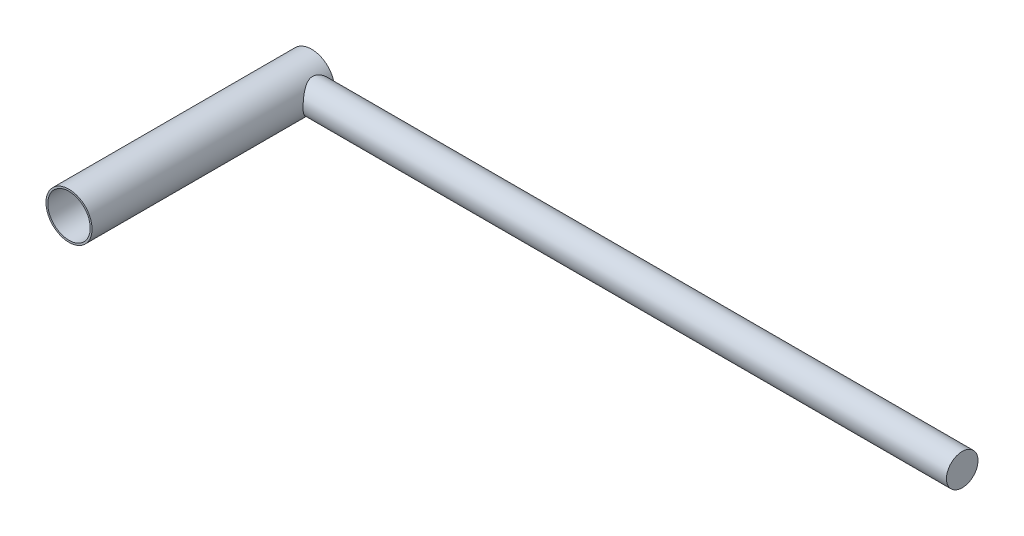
from build123d import *

# Parameters (mm, degrees)
CROQUIS1_R              = 19
SALIENTE_EXTRUIR1_DEPTH = 200
CROQUIS2_R              = 13
SALIENTE_EXTRUIR2_DEPTH = 549.452
CROQUIS3_R              = 4.7625
CORTAR_EXTRUIR2_DEPTH   = 23
CROQUIS4_R              = 11.5
CORTAR_EXTRUIR3_DEPTH   = 546
CROQUIS5_R              = 17.5
CORTAR_EXTRUIR4_DEPTH   = 198


with BuildPart() as part:
    # Croquis1 → Saliente-Extruir1 (new body)
    with BuildSketch(Plane.XY):
        Circle(CROQUIS1_R)
    extrude(amount=SALIENTE_EXTRUIR1_DEPTH)

    # Croquis2 → Saliente-Extruir2 (add)
    with BuildSketch(Plane(origin=(0, 0, 0), x_dir=(0, 0, -1), z_dir=(1, 0, 0))):
        with Locations((-13, 0)):
            Circle(CROQUIS2_R)
    extrude(amount=SALIENTE_EXTRUIR2_DEPTH)

    # Croquis3 → Cortar-Extruir2 (cut)
    with BuildSketch(Plane.XY):
        with Locations((538.276, 0)):
            Circle(CROQUIS3_R)
        with Locations((512.876, 0)):
            Circle(CROQUIS3_R)
        with Locations((487.476, 0)):
            Circle(CROQUIS3_R)
        with Locations((462.076, 0)):
            Circle(CROQUIS3_R)
        with Locations((436.676, 0)):
            Circle(CROQUIS3_R)
        with Locations((411.276, 0)):
            Circle(CROQUIS3_R)
        with Locations((385.876, 0)):
            Circle(CROQUIS3_R)
        with Locations((360.476, 0)):
            Circle(CROQUIS3_R)
        with Locations((335.076, 0)):
            Circle(CROQUIS3_R)
        with Locations((309.676, 0)):
            Circle(CROQUIS3_R)
        with Locations((284.276, 0)):
            Circle(CROQUIS3_R)
        with Locations((258.876, 0)):
            Circle(CROQUIS3_R)
        with Locations((233.476, 0)):
            Circle(CROQUIS3_R)
        with Locations((208.076, 0)):
            Circle(CROQUIS3_R)
        with Locations((182.676, 0)):
            Circle(CROQUIS3_R)
        with Locations((157.276, 0)):
            Circle(CROQUIS3_R)
        with Locations((131.876, 0)):
            Circle(CROQUIS3_R)
        with Locations((106.476, 0)):
            Circle(CROQUIS3_R)
        with Locations((81.076, 0)):
            Circle(CROQUIS3_R)
        with Locations((55.676, 0)):
            Circle(CROQUIS3_R)
        with Locations((30.276, 0)):
            Circle(CROQUIS3_R)
        with Locations((4.876, 0)):
            Circle(CROQUIS3_R)
    extrude(amount=CORTAR_EXTRUIR2_DEPTH, mode=Mode.SUBTRACT)

    # Croquis4 → Cortar-Extruir3 (cut)
    with BuildSketch(Plane(origin=(0, 0, 0), x_dir=(0, 0, -1), z_dir=(1, 0, 0))):
        with Locations((-13, 0)):
            Circle(CROQUIS4_R)
    extrude(amount=CORTAR_EXTRUIR3_DEPTH, mode=Mode.SUBTRACT)

    # Croquis5 → Cortar-Extruir4 (cut)
    with BuildSketch(Plane.XY.offset(200)):
        Circle(CROQUIS5_R)
    extrude(amount=-CORTAR_EXTRUIR4_DEPTH, mode=Mode.SUBTRACT)


solid = part.part
